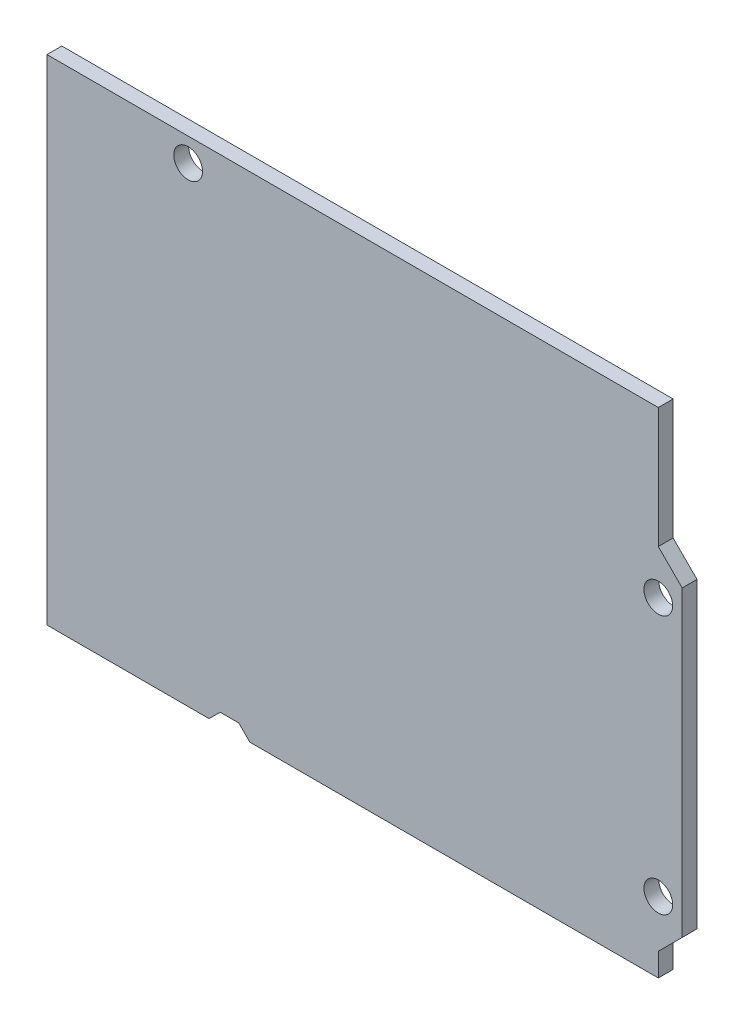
from build123d import *

# Parameters (mm, degrees)
ESQUISSE1_R        = 1.55
BOSS_EXTRU_1_DEPTH = 1.6


with BuildPart() as part:
    # Esquisse1 → Boss.-Extru.1 (new body)
    with BuildSketch(Plane.XY):
        Polygon((0, 0), (0, 53.34), (66, 53.34), (66, 40.34), (68.58, 37.76), (68.58, 5.08), (66, 2.5), (66, 0), (21.9, 0), (20.7, 1.2), (18.7, 1.2), (17.5, 0), align=None)
        with Locations((15.24, 50.8)):
            Circle(ESQUISSE1_R, mode=Mode.SUBTRACT)
        with Locations((66, 35.56)):
            Circle(ESQUISSE1_R, mode=Mode.SUBTRACT)
        with Locations((66, 7.62)):
            Circle(ESQUISSE1_R, mode=Mode.SUBTRACT)
    extrude(amount=BOSS_EXTRU_1_DEPTH)


solid = part.part
